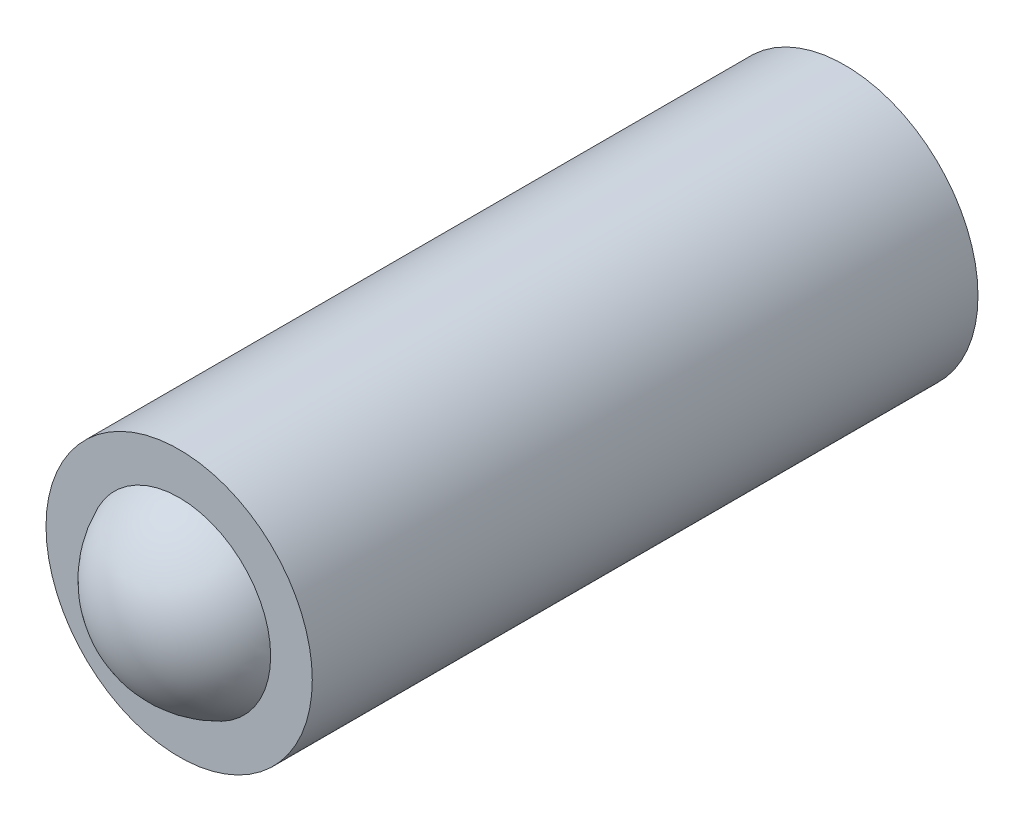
ISO-10303-21;
HEADER;
FILE_DESCRIPTION(('STEP AP214'),'2;1');
FILE_NAME('part.step','',(''),(''),'','','');
FILE_SCHEMA(('AUTOMOTIVE_DESIGN { 1 0 10303 214 1 1 1 1 }'));
ENDSEC;
DATA;
#1=APPLICATION_CONTEXT('core data for automotive mechanical design processes');
#2=APPLICATION_PROTOCOL_DEFINITION('international standard','automotive_design',2000,#1);
#3=PRODUCT_CONTEXT('',#1,'mechanical');
#4=PRODUCT('Part','Part','',(#3));
#5=PRODUCT_RELATED_PRODUCT_CATEGORY('part','',(#4));
#6=PRODUCT_DEFINITION_FORMATION('','',#4);
#7=PRODUCT_DEFINITION_CONTEXT('part definition',#1,'design');
#8=PRODUCT_DEFINITION('design','',#6,#7);
#9=PRODUCT_DEFINITION_SHAPE('','',#8);
#10=(LENGTH_UNIT() NAMED_UNIT(*) SI_UNIT(.MILLI.,.METRE.));
#11=(NAMED_UNIT(*) PLANE_ANGLE_UNIT() SI_UNIT($,.RADIAN.));
#12=(NAMED_UNIT(*) SI_UNIT($,.STERADIAN.) SOLID_ANGLE_UNIT());
#13=UNCERTAINTY_MEASURE_WITH_UNIT(LENGTH_MEASURE(1.E-05),#10,'distance_accuracy_value','');
#14=(GEOMETRIC_REPRESENTATION_CONTEXT(3) GLOBAL_UNCERTAINTY_ASSIGNED_CONTEXT((#13)) GLOBAL_UNIT_ASSIGNED_CONTEXT((#10,
#11,#12)) REPRESENTATION_CONTEXT('',''));
#15=CARTESIAN_POINT('',(0.,0.,0.));
#16=DIRECTION('',(0.,0.,1.));
#17=DIRECTION('',(1.,0.,0.));
#18=AXIS2_PLACEMENT_3D('',#15,#16,#17);
#19=CARTESIAN_POINT('',(0.,0.,-4.4));
#20=DIRECTION('',(0.,0.,1.));
#21=DIRECTION('',(0.,-1.,0.));
#22=AXIS2_PLACEMENT_3D('',#19,#20,#21);
#23=SPHERICAL_SURFACE('',#22,1.5);
#24=CARTESIAN_POINT('',(0.,0.,-5.));
#25=DIRECTION('',(0.,0.,1.));
#26=DIRECTION('',(1.,0.,0.));
#27=AXIS2_PLACEMENT_3D('',#24,#25,#26);
#28=CIRCLE('',#27,1.37477270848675);
#29=CARTESIAN_POINT('',(1.37477270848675,0.,-5.));
#30=VERTEX_POINT('',#29);
#31=EDGE_CURVE('E26',#30,#30,#28,.T.);
#32=ORIENTED_EDGE('',*,*,#31,.F.);
#33=EDGE_LOOP('',(#32));
#34=FACE_BOUND('',#33,.T.);
#35=ADVANCED_FACE('F12',(#34),#23,.T.);
#36=CARTESIAN_POINT('',(0.,0.,4.4));
#37=DIRECTION('',(0.,0.,1.));
#38=DIRECTION('',(0.,1.,0.));
#39=AXIS2_PLACEMENT_3D('',#36,#37,#38);
#40=SPHERICAL_SURFACE('',#39,1.5);
#41=CARTESIAN_POINT('',(0.,0.,5.));
#42=DIRECTION('',(0.,0.,1.));
#43=DIRECTION('',(1.,0.,0.));
#44=AXIS2_PLACEMENT_3D('',#41,#42,#43);
#45=CIRCLE('',#44,1.37477270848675);
#46=CARTESIAN_POINT('',(1.37477270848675,0.,5.));
#47=VERTEX_POINT('',#46);
#48=EDGE_CURVE('E8',#47,#47,#45,.T.);
#49=ORIENTED_EDGE('',*,*,#48,.T.);
#50=EDGE_LOOP('',(#49));
#51=FACE_BOUND('',#50,.T.);
#52=ADVANCED_FACE('F36',(#51),#40,.T.);
#53=CARTESIAN_POINT('',(0.,-1.37477270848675,5.));
#54=DIRECTION('',(0.,0.,1.));
#55=DIRECTION('',(1.,0.,0.));
#56=AXIS2_PLACEMENT_3D('',#53,#54,#55);
#57=PLANE('',#56);
#58=CARTESIAN_POINT('',(0.,0.,5.));
#59=DIRECTION('',(0.,0.,1.));
#60=DIRECTION('',(1.,0.,0.));
#61=AXIS2_PLACEMENT_3D('',#58,#59,#60);
#62=CIRCLE('',#61,2.);
#63=CARTESIAN_POINT('',(2.,0.,5.));
#64=VERTEX_POINT('',#63);
#65=EDGE_CURVE('E18',#64,#64,#62,.T.);
#66=ORIENTED_EDGE('',*,*,#65,.T.);
#67=EDGE_LOOP('',(#66));
#68=FACE_BOUND('',#67,.T.);
#69=ORIENTED_EDGE('',*,*,#48,.F.);
#70=EDGE_LOOP('',(#69));
#71=FACE_BOUND('',#70,.T.);
#72=ADVANCED_FACE('F42',(#68,#71),#57,.T.);
#73=CARTESIAN_POINT('',(0.,0.,7.56311397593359));
#74=DIRECTION('',(0.,0.,1.));
#75=DIRECTION('',(1.,0.,0.));
#76=AXIS2_PLACEMENT_3D('',#73,#74,#75);
#77=CYLINDRICAL_SURFACE('',#76,2.);
#78=CARTESIAN_POINT('',(0.,0.,-5.));
#79=DIRECTION('',(0.,0.,1.));
#80=DIRECTION('',(1.,0.,0.));
#81=AXIS2_PLACEMENT_3D('',#78,#79,#80);
#82=CIRCLE('',#81,2.);
#83=CARTESIAN_POINT('',(2.,0.,-5.));
#84=VERTEX_POINT('',#83);
#85=EDGE_CURVE('E22',#84,#84,#82,.T.);
#86=ORIENTED_EDGE('',*,*,#85,.T.);
#87=EDGE_LOOP('',(#86));
#88=FACE_BOUND('',#87,.T.);
#89=ORIENTED_EDGE('',*,*,#65,.F.);
#90=EDGE_LOOP('',(#89));
#91=FACE_BOUND('',#90,.T.);
#92=ADVANCED_FACE('F47',(#88,#91),#77,.T.);
#93=CARTESIAN_POINT('',(0.,-1.37477270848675,-5.));
#94=DIRECTION('',(0.,0.,-1.));
#95=DIRECTION('',(-1.,0.,0.));
#96=AXIS2_PLACEMENT_3D('',#93,#94,#95);
#97=PLANE('',#96);
#98=ORIENTED_EDGE('',*,*,#31,.T.);
#99=EDGE_LOOP('',(#98));
#100=FACE_BOUND('',#99,.T.);
#101=ORIENTED_EDGE('',*,*,#85,.F.);
#102=EDGE_LOOP('',(#101));
#103=FACE_BOUND('',#102,.T.);
#104=ADVANCED_FACE('F32',(#100,#103),#97,.T.);
#105=CLOSED_SHELL('',(#35,#52,#72,#92,#104));
#106=MANIFOLD_SOLID_BREP('B1',#105);
#107=ADVANCED_BREP_SHAPE_REPRESENTATION('',(#18,#106),#14);
#108=SHAPE_DEFINITION_REPRESENTATION(#9,#107);
ENDSEC;
END-ISO-10303-21;
